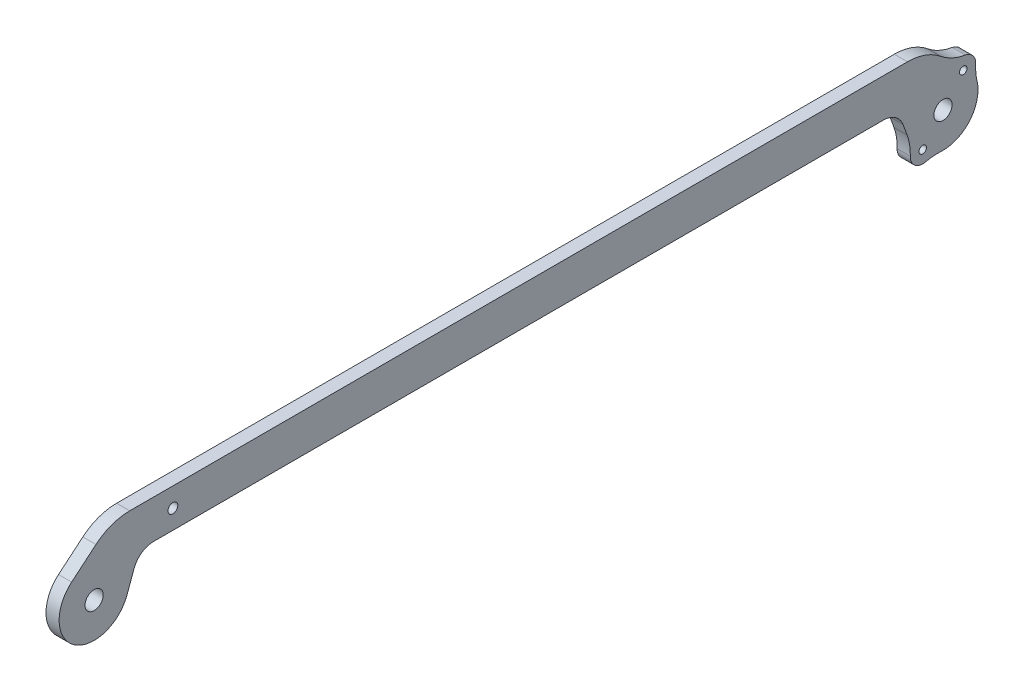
ISO-10303-21;
HEADER;
FILE_DESCRIPTION(('STEP AP214'),'2;1');
FILE_NAME('part.step','',(''),(''),'','','');
FILE_SCHEMA(('AUTOMOTIVE_DESIGN { 1 0 10303 214 1 1 1 1 }'));
ENDSEC;
DATA;
#1=APPLICATION_CONTEXT('core data for automotive mechanical design processes');
#2=APPLICATION_PROTOCOL_DEFINITION('international standard','automotive_design',2000,#1);
#3=PRODUCT_CONTEXT('',#1,'mechanical');
#4=PRODUCT('Part','Part','',(#3));
#5=PRODUCT_RELATED_PRODUCT_CATEGORY('part','',(#4));
#6=PRODUCT_DEFINITION_FORMATION('','',#4);
#7=PRODUCT_DEFINITION_CONTEXT('part definition',#1,'design');
#8=PRODUCT_DEFINITION('design','',#6,#7);
#9=PRODUCT_DEFINITION_SHAPE('','',#8);
#10=(LENGTH_UNIT() NAMED_UNIT(*) SI_UNIT(.MILLI.,.METRE.));
#11=(NAMED_UNIT(*) PLANE_ANGLE_UNIT() SI_UNIT($,.RADIAN.));
#12=(NAMED_UNIT(*) SI_UNIT($,.STERADIAN.) SOLID_ANGLE_UNIT());
#13=UNCERTAINTY_MEASURE_WITH_UNIT(LENGTH_MEASURE(1.E-05),#10,'distance_accuracy_value','');
#14=(GEOMETRIC_REPRESENTATION_CONTEXT(3) GLOBAL_UNCERTAINTY_ASSIGNED_CONTEXT((#13)) GLOBAL_UNIT_ASSIGNED_CONTEXT((#10,
#11,#12)) REPRESENTATION_CONTEXT('',''));
#15=CARTESIAN_POINT('',(0.,0.,0.));
#16=DIRECTION('',(0.,0.,1.));
#17=DIRECTION('',(1.,0.,0.));
#18=AXIS2_PLACEMENT_3D('',#15,#16,#17);
#19=CARTESIAN_POINT('',(4.7625,0.,-307.975));
#20=DIRECTION('',(-1.,0.,0.));
#21=DIRECTION('',(0.,0.,1.));
#22=AXIS2_PLACEMENT_3D('',#19,#20,#21);
#23=CYLINDRICAL_SURFACE('',#22,12.7);
#24=DIRECTION('',(1.,0.,0.));
#25=VECTOR('',#24,1.);
#26=CARTESIAN_POINT('',(-19.6871358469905,-12.6774406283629,-307.218363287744));
#27=LINE('',#26,#25);
#28=CARTESIAN_POINT('',(0.,-12.6774406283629,-307.218363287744));
#29=VERTEX_POINT('',#28);
#30=CARTESIAN_POINT('',(4.7625,-12.6774406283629,-307.218363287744));
#31=VERTEX_POINT('',#30);
#32=EDGE_CURVE('E195',#29,#31,#27,.T.);
#33=ORIENTED_EDGE('',*,*,#32,.F.);
#34=CARTESIAN_POINT('',(0.,0.,-307.975));
#35=DIRECTION('',(1.,0.,0.));
#36=DIRECTION('',(0.,0.,-1.));
#37=AXIS2_PLACEMENT_3D('',#34,#35,#36);
#38=CIRCLE('',#37,12.7);
#39=CARTESIAN_POINT('',(0.,2.94655616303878,-320.328453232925));
#40=VERTEX_POINT('',#39);
#41=EDGE_CURVE('E289',#29,#40,#38,.T.);
#42=ORIENTED_EDGE('',*,*,#41,.T.);
#43=DIRECTION('',(1.,0.,0.));
#44=VECTOR('',#43,1.);
#45=CARTESIAN_POINT('',(-19.6871358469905,2.94655616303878,-320.328453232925));
#46=LINE('',#45,#44);
#47=CARTESIAN_POINT('',(4.7625,2.94655616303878,-320.328453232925));
#48=VERTEX_POINT('',#47);
#49=EDGE_CURVE('E227',#40,#48,#46,.T.);
#50=ORIENTED_EDGE('',*,*,#49,.T.);
#51=CARTESIAN_POINT('',(4.7625,0.,-307.975));
#52=DIRECTION('',(1.,0.,0.));
#53=DIRECTION('',(0.,0.,-1.));
#54=AXIS2_PLACEMENT_3D('',#51,#52,#53);
#55=CIRCLE('',#54,12.7);
#56=EDGE_CURVE('E270',#31,#48,#55,.T.);
#57=ORIENTED_EDGE('',*,*,#56,.F.);
#58=EDGE_LOOP('',(#33,#42,#50,#57));
#59=FACE_BOUND('',#58,.T.);
#60=ADVANCED_FACE('F60',(#59),#23,.T.);
#61=CARTESIAN_POINT('',(4.7625,0.,-21.6240923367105));
#62=DIRECTION('',(-1.,0.,0.));
#63=DIRECTION('',(0.,0.,1.));
#64=AXIS2_PLACEMENT_3D('',#61,#62,#63);
#65=PLANE('',#64);
#66=CARTESIAN_POINT('',(4.7625,14.605,-28.575));
#67=DIRECTION('',(1.,0.,0.));
#68=DIRECTION('',(0.,0.,-1.));
#69=AXIS2_PLACEMENT_3D('',#66,#67,#68);
#70=CIRCLE('',#69,1.778);
#71=CARTESIAN_POINT('',(4.7625,14.605,-30.353));
#72=VERTEX_POINT('',#71);
#73=EDGE_CURVE('E469',#72,#72,#70,.T.);
#74=ORIENTED_EDGE('',*,*,#73,.F.);
#75=EDGE_LOOP('',(#74));
#76=FACE_BOUND('',#75,.T.);
#77=CARTESIAN_POINT('',(4.7625,8.75588798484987,-315.322062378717));
#78=DIRECTION('',(1.,0.,0.));
#79=DIRECTION('',(0.,0.,-1.));
#80=AXIS2_PLACEMENT_3D('',#77,#78,#79);
#81=CIRCLE('',#80,1.35255000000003);
#82=CARTESIAN_POINT('',(4.7625,8.75588798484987,-316.674612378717));
#83=VERTEX_POINT('',#82);
#84=EDGE_CURVE('E215',#83,#83,#81,.T.);
#85=ORIENTED_EDGE('',*,*,#84,.F.);
#86=EDGE_LOOP('',(#85));
#87=FACE_BOUND('',#86,.T.);
#88=CARTESIAN_POINT('',(4.7625,-8.75588798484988,-300.627937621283));
#89=DIRECTION('',(1.,0.,0.));
#90=DIRECTION('',(0.,0.,-1.));
#91=AXIS2_PLACEMENT_3D('',#88,#89,#90);
#92=CIRCLE('',#91,1.35255000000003);
#93=CARTESIAN_POINT('',(4.7625,-8.75588798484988,-301.980487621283));
#94=VERTEX_POINT('',#93);
#95=EDGE_CURVE('E363',#94,#94,#92,.T.);
#96=ORIENTED_EDGE('',*,*,#95,.F.);
#97=EDGE_LOOP('',(#96));
#98=FACE_BOUND('',#97,.T.);
#99=DIRECTION('',(0.,0.,1.));
#100=VECTOR('',#99,1.);
#101=CARTESIAN_POINT('',(4.7625,21.59,-5.97226746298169));
#102=LINE('',#101,#100);
#103=CARTESIAN_POINT('',(4.7625,21.59,-295.07308975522));
#104=VERTEX_POINT('',#103);
#105=CARTESIAN_POINT('',(4.7625,21.59,-12.9059004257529));
#106=VERTEX_POINT('',#105);
#107=EDGE_CURVE('E272',#104,#106,#102,.T.);
#108=ORIENTED_EDGE('',*,*,#107,.T.);
#109=CARTESIAN_POINT('',(4.7625,2.54,-12.9059004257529));
#110=DIRECTION('',(-1.,0.,0.));
#111=DIRECTION('',(0.,0.,1.));
#112=AXIS2_PLACEMENT_3D('',#109,#110,#111);
#113=CIRCLE('',#112,19.05);
#114=CARTESIAN_POINT('',(4.7625,17.1331466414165,-0.660796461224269));
#115=VERTEX_POINT('',#114);
#116=EDGE_CURVE('E68',#106,#115,#113,.F.);
#117=ORIENTED_EDGE('',*,*,#116,.T.);
#118=DIRECTION('',(0.,-0.642787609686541,0.766044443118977));
#119=VECTOR('',#118,1.);
#120=CARTESIAN_POINT('',(4.7625,9.72876442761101,8.16340264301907));
#121=LINE('',#120,#119);
#122=CARTESIAN_POINT('',(4.7625,9.728764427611,8.16340264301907));
#123=VERTEX_POINT('',#122);
#124=EDGE_CURVE('E274',#115,#123,#121,.T.);
#125=ORIENTED_EDGE('',*,*,#124,.T.);
#126=CARTESIAN_POINT('',(4.7625,0.,0.));
#127=DIRECTION('',(1.,0.,0.));
#128=DIRECTION('',(0.,0.,-1.));
#129=AXIS2_PLACEMENT_3D('',#126,#127,#128);
#130=CIRCLE('',#129,12.7);
#131=CARTESIAN_POINT('',(4.7625,-4.343655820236,-11.934096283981));
#132=VERTEX_POINT('',#131);
#133=EDGE_CURVE('E276',#123,#132,#130,.T.);
#134=ORIENTED_EDGE('',*,*,#133,.T.);
#135=DIRECTION('',(0.,0.939692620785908,-0.342020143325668));
#136=VECTOR('',#135,1.);
#137=CARTESIAN_POINT('',(4.7625,-4.343655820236,-11.934096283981));
#138=LINE('',#137,#136);
#139=CARTESIAN_POINT('',(4.7625,2.6061934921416,-14.4636345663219));
#140=VERTEX_POINT('',#139);
#141=EDGE_CURVE('E278',#132,#140,#138,.T.);
#142=ORIENTED_EDGE('',*,*,#141,.T.);
#143=CARTESIAN_POINT('',(4.7625,0.,-21.6240923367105));
#144=DIRECTION('',(-1.,0.,0.));
#145=DIRECTION('',(0.,0.,1.));
#146=AXIS2_PLACEMENT_3D('',#143,#144,#145);
#147=CIRCLE('',#146,7.62);
#148=CARTESIAN_POINT('',(4.7625,7.62,-21.6240923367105));
#149=VERTEX_POINT('',#148);
#150=EDGE_CURVE('E259',#140,#149,#147,.T.);
#151=ORIENTED_EDGE('',*,*,#150,.T.);
#152=DIRECTION('',(0.,0.,-1.));
#153=VECTOR('',#152,1.);
#154=CARTESIAN_POINT('',(4.7625,7.62,-21.6240923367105));
#155=LINE('',#154,#153);
#156=CARTESIAN_POINT('',(4.7625,7.62000000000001,-286.350907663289));
#157=VERTEX_POINT('',#156);
#158=EDGE_CURVE('E262',#149,#157,#155,.T.);
#159=ORIENTED_EDGE('',*,*,#158,.T.);
#160=CARTESIAN_POINT('',(4.7625,0.,-286.350907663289));
#161=DIRECTION('',(-1.,0.,0.));
#162=DIRECTION('',(0.,0.,1.));
#163=AXIS2_PLACEMENT_3D('',#160,#161,#162);
#164=CIRCLE('',#163,7.62000000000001);
#165=CARTESIAN_POINT('',(4.7625,2.60619349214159,-293.511365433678));
#166=VERTEX_POINT('',#165);
#167=EDGE_CURVE('E265',#157,#166,#164,.T.);
#168=ORIENTED_EDGE('',*,*,#167,.T.);
#169=DIRECTION('',(0.,-0.939692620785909,-0.342020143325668));
#170=VECTOR('',#169,1.);
#171=CARTESIAN_POINT('',(4.7625,2.60619349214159,-293.511365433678));
#172=LINE('',#171,#170);
#173=CARTESIAN_POINT('',(4.7625,-1.39253114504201,-294.96678217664));
#174=VERTEX_POINT('',#173);
#175=EDGE_CURVE('E267',#166,#174,#172,.T.);
#176=ORIENTED_EDGE('',*,*,#175,.T.);
#177=CARTESIAN_POINT('',(4.7625,-7.90801487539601,-277.065637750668));
#178=DIRECTION('',(1.,0.,0.));
#179=DIRECTION('',(0.,0.,-1.));
#180=AXIS2_PLACEMENT_3D('',#177,#178,#179);
#181=CIRCLE('',#180,19.05);
#182=CARTESIAN_POINT('',(4.7625,-8.59307259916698,-296.103316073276));
#183=VERTEX_POINT('',#182);
#184=EDGE_CURVE('E206',#183,#174,#181,.T.);
#185=ORIENTED_EDGE('',*,*,#184,.F.);
#186=CARTESIAN_POINT('',(4.7625,-8.75588798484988,-300.627937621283));
#187=DIRECTION('',(1.,0.,0.));
#188=DIRECTION('',(0.,0.,-1.));
#189=AXIS2_PLACEMENT_3D('',#186,#187,#188);
#190=CIRCLE('',#189,4.52755000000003);
#191=CARTESIAN_POINT('',(4.7625,-13.1605714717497,-301.675540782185));
#192=VERTEX_POINT('',#191);
#193=EDGE_CURVE('E202',#183,#192,#190,.T.);
#194=ORIENTED_EDGE('',*,*,#193,.T.);
#195=CARTESIAN_POINT('',(4.7625,-31.6936015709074,-306.083408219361));
#196=DIRECTION('',(1.,0.,0.));
#197=DIRECTION('',(0.,0.,-1.));
#198=AXIS2_PLACEMENT_3D('',#195,#196,#197);
#199=CIRCLE('',#198,19.05);
#200=EDGE_CURVE('E212',#192,#31,#199,.F.);
#201=ORIENTED_EDGE('',*,*,#200,.T.);
#202=ORIENTED_EDGE('',*,*,#56,.T.);
#203=CARTESIAN_POINT('',(4.7625,7.36639040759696,-338.858633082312));
#204=DIRECTION('',(1.,0.,0.));
#205=DIRECTION('',(0.,0.,-1.));
#206=AXIS2_PLACEMENT_3D('',#203,#204,#205);
#207=CIRCLE('',#206,19.05);
#208=CARTESIAN_POINT('',(4.7625,8.48906553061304,-319.84174320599));
#209=VERTEX_POINT('',#208);
#210=EDGE_CURVE('E229',#209,#48,#207,.T.);
#211=ORIENTED_EDGE('',*,*,#210,.F.);
#212=CARTESIAN_POINT('',(4.7625,8.75588798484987,-315.322062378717));
#213=DIRECTION('',(1.,0.,0.));
#214=DIRECTION('',(0.,0.,-1.));
#215=AXIS2_PLACEMENT_3D('',#212,#213,#214);
#216=CIRCLE('',#215,4.52755000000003);
#217=CARTESIAN_POINT('',(4.7625,13.2210391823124,-316.071151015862));
#218=VERTEX_POINT('',#217);
#219=EDGE_CURVE('E224',#209,#218,#216,.T.);
#220=ORIENTED_EDGE('',*,*,#219,.T.);
#221=CARTESIAN_POINT('',(4.7625,32.0084916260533,-319.222996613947));
#222=DIRECTION('',(1.,0.,0.));
#223=DIRECTION('',(0.,0.,-1.));
#224=AXIS2_PLACEMENT_3D('',#221,#222,#223);
#225=CIRCLE('',#224,19.05);
#226=CARTESIAN_POINT('',(4.7625,17.2742458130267,-307.148043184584));
#227=VERTEX_POINT('',#226);
#228=EDGE_CURVE('E228',#218,#227,#225,.F.);
#229=ORIENTED_EDGE('',*,*,#228,.T.);
#230=CARTESIAN_POINT('',(4.7625,2.54000000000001,-295.07308975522));
#231=DIRECTION('',(-1.,0.,0.));
#232=DIRECTION('',(0.,0.,1.));
#233=AXIS2_PLACEMENT_3D('',#230,#231,#232);
#234=CIRCLE('',#233,19.05);
#235=EDGE_CURVE('E326',#227,#104,#234,.F.);
#236=ORIENTED_EDGE('',*,*,#235,.T.);
#237=EDGE_LOOP('',(#108,#117,#125,#134,#142,#151,#159,#168,#176,#185,#194,#201,#202,#211,#220,
#229,#236));
#238=FACE_BOUND('',#237,.T.);
#239=CARTESIAN_POINT('',(4.7625,0.,0.));
#240=DIRECTION('',(1.,0.,0.));
#241=DIRECTION('',(0.,0.,-1.));
#242=AXIS2_PLACEMENT_3D('',#239,#240,#241);
#243=CIRCLE('',#242,3.302);
#244=CARTESIAN_POINT('',(4.7625,0.,3.302));
#245=VERTEX_POINT('',#244);
#246=EDGE_CURVE('E253',#245,#245,#243,.T.);
#247=ORIENTED_EDGE('',*,*,#246,.F.);
#248=EDGE_LOOP('',(#247));
#249=FACE_BOUND('',#248,.T.);
#250=CARTESIAN_POINT('',(4.7625,0.,-307.975));
#251=DIRECTION('',(1.,0.,0.));
#252=DIRECTION('',(0.,0.,-1.));
#253=AXIS2_PLACEMENT_3D('',#250,#251,#252);
#254=CIRCLE('',#253,3.30200000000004);
#255=CARTESIAN_POINT('',(4.7625,0.,-304.673));
#256=VERTEX_POINT('',#255);
#257=EDGE_CURVE('E247',#256,#256,#254,.T.);
#258=ORIENTED_EDGE('',*,*,#257,.F.);
#259=EDGE_LOOP('',(#258));
#260=FACE_BOUND('',#259,.T.);
#261=ADVANCED_FACE('F330',(#76,#87,#98,#238,#249,#260),#65,.F.);
#262=CARTESIAN_POINT('',(0.,0.,-21.6240923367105));
#263=DIRECTION('',(-1.,0.,0.));
#264=DIRECTION('',(0.,0.,1.));
#265=AXIS2_PLACEMENT_3D('',#262,#263,#264);
#266=PLANE('',#265);
#267=CARTESIAN_POINT('',(0.,14.605,-28.575));
#268=DIRECTION('',(1.,0.,0.));
#269=DIRECTION('',(0.,0.,-1.));
#270=AXIS2_PLACEMENT_3D('',#267,#268,#269);
#271=CIRCLE('',#270,1.778);
#272=CARTESIAN_POINT('',(0.,14.605,-30.353));
#273=VERTEX_POINT('',#272);
#274=EDGE_CURVE('E460',#273,#273,#271,.T.);
#275=ORIENTED_EDGE('',*,*,#274,.T.);
#276=EDGE_LOOP('',(#275));
#277=FACE_BOUND('',#276,.T.);
#278=CARTESIAN_POINT('',(0.,8.75588798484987,-315.322062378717));
#279=DIRECTION('',(1.,0.,0.));
#280=DIRECTION('',(0.,0.,-1.));
#281=AXIS2_PLACEMENT_3D('',#278,#279,#280);
#282=CIRCLE('',#281,1.35255000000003);
#283=CARTESIAN_POINT('',(0.,8.75588798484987,-316.674612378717));
#284=VERTEX_POINT('',#283);
#285=EDGE_CURVE('E210',#284,#284,#282,.T.);
#286=ORIENTED_EDGE('',*,*,#285,.T.);
#287=EDGE_LOOP('',(#286));
#288=FACE_BOUND('',#287,.T.);
#289=CARTESIAN_POINT('',(0.,-8.75588798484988,-300.627937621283));
#290=DIRECTION('',(1.,0.,0.));
#291=DIRECTION('',(0.,0.,-1.));
#292=AXIS2_PLACEMENT_3D('',#289,#290,#291);
#293=CIRCLE('',#292,1.35255000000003);
#294=CARTESIAN_POINT('',(0.,-8.75588798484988,-301.980487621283));
#295=VERTEX_POINT('',#294);
#296=EDGE_CURVE('E464',#295,#295,#293,.T.);
#297=ORIENTED_EDGE('',*,*,#296,.T.);
#298=EDGE_LOOP('',(#297));
#299=FACE_BOUND('',#298,.T.);
#300=DIRECTION('',(0.,-0.642787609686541,0.766044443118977));
#301=VECTOR('',#300,1.);
#302=CARTESIAN_POINT('',(0.,9.72876442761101,8.16340264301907));
#303=LINE('',#302,#301);
#304=CARTESIAN_POINT('',(0.,17.1331466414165,-0.660796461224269));
#305=VERTEX_POINT('',#304);
#306=CARTESIAN_POINT('',(0.,9.728764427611,8.16340264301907));
#307=VERTEX_POINT('',#306);
#308=EDGE_CURVE('E293',#305,#307,#303,.T.);
#309=ORIENTED_EDGE('',*,*,#308,.F.);
#310=CARTESIAN_POINT('',(0.,2.54,-12.9059004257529));
#311=DIRECTION('',(-1.,0.,0.));
#312=DIRECTION('',(0.,0.,1.));
#313=AXIS2_PLACEMENT_3D('',#310,#311,#312);
#314=CIRCLE('',#313,19.05);
#315=CARTESIAN_POINT('',(0.,21.59,-12.9059004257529));
#316=VERTEX_POINT('',#315);
#317=EDGE_CURVE('E320',#305,#316,#314,.T.);
#318=ORIENTED_EDGE('',*,*,#317,.T.);
#319=DIRECTION('',(0.,0.,1.));
#320=VECTOR('',#319,1.);
#321=CARTESIAN_POINT('',(0.,21.59,-5.97226746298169));
#322=LINE('',#321,#320);
#323=CARTESIAN_POINT('',(0.,21.59,-295.07308975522));
#324=VERTEX_POINT('',#323);
#325=EDGE_CURVE('E291',#324,#316,#322,.T.);
#326=ORIENTED_EDGE('',*,*,#325,.F.);
#327=CARTESIAN_POINT('',(0.,2.54000000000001,-295.07308975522));
#328=DIRECTION('',(-1.,0.,0.));
#329=DIRECTION('',(0.,0.,1.));
#330=AXIS2_PLACEMENT_3D('',#327,#328,#329);
#331=CIRCLE('',#330,19.05);
#332=CARTESIAN_POINT('',(0.,17.2742458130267,-307.148043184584));
#333=VERTEX_POINT('',#332);
#334=EDGE_CURVE('E318',#324,#333,#331,.T.);
#335=ORIENTED_EDGE('',*,*,#334,.T.);
#336=CARTESIAN_POINT('',(0.,32.0084916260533,-319.222996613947));
#337=DIRECTION('',(-1.,0.,0.));
#338=DIRECTION('',(0.,0.,1.));
#339=AXIS2_PLACEMENT_3D('',#336,#337,#338);
#340=CIRCLE('',#339,19.05);
#341=CARTESIAN_POINT('',(0.,13.2210391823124,-316.071151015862));
#342=VERTEX_POINT('',#341);
#343=EDGE_CURVE('E235',#342,#333,#340,.T.);
#344=ORIENTED_EDGE('',*,*,#343,.F.);
#345=CARTESIAN_POINT('',(0.,8.75588798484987,-315.322062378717));
#346=DIRECTION('',(-1.,0.,0.));
#347=DIRECTION('',(0.,0.,1.));
#348=AXIS2_PLACEMENT_3D('',#345,#346,#347);
#349=CIRCLE('',#348,4.52755000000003);
#350=CARTESIAN_POINT('',(0.,8.48906553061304,-319.84174320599));
#351=VERTEX_POINT('',#350);
#352=EDGE_CURVE('E232',#351,#342,#349,.F.);
#353=ORIENTED_EDGE('',*,*,#352,.F.);
#354=CARTESIAN_POINT('',(0.,7.36639040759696,-338.858633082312));
#355=DIRECTION('',(-1.,0.,0.));
#356=DIRECTION('',(0.,0.,1.));
#357=AXIS2_PLACEMENT_3D('',#354,#355,#356);
#358=CIRCLE('',#357,19.05);
#359=EDGE_CURVE('E220',#351,#40,#358,.F.);
#360=ORIENTED_EDGE('',*,*,#359,.T.);
#361=ORIENTED_EDGE('',*,*,#41,.F.);
#362=CARTESIAN_POINT('',(0.,-31.6936015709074,-306.083408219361));
#363=DIRECTION('',(-1.,0.,0.));
#364=DIRECTION('',(0.,0.,1.));
#365=AXIS2_PLACEMENT_3D('',#362,#363,#364);
#366=CIRCLE('',#365,19.05);
#367=CARTESIAN_POINT('',(0.,-13.1605714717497,-301.675540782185));
#368=VERTEX_POINT('',#367);
#369=EDGE_CURVE('E192',#368,#29,#366,.T.);
#370=ORIENTED_EDGE('',*,*,#369,.F.);
#371=CARTESIAN_POINT('',(0.,-8.75588798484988,-300.627937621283));
#372=DIRECTION('',(-1.,0.,0.));
#373=DIRECTION('',(0.,0.,1.));
#374=AXIS2_PLACEMENT_3D('',#371,#372,#373);
#375=CIRCLE('',#374,4.52755000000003);
#376=CARTESIAN_POINT('',(0.,-8.59307259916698,-296.103316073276));
#377=VERTEX_POINT('',#376);
#378=EDGE_CURVE('E181',#377,#368,#375,.F.);
#379=ORIENTED_EDGE('',*,*,#378,.F.);
#380=CARTESIAN_POINT('',(0.,-7.90801487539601,-277.065637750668));
#381=DIRECTION('',(-1.,0.,0.));
#382=DIRECTION('',(0.,0.,1.));
#383=AXIS2_PLACEMENT_3D('',#380,#381,#382);
#384=CIRCLE('',#383,19.05);
#385=CARTESIAN_POINT('',(0.,-1.39253114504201,-294.96678217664));
#386=VERTEX_POINT('',#385);
#387=EDGE_CURVE('E188',#377,#386,#384,.F.);
#388=ORIENTED_EDGE('',*,*,#387,.T.);
#389=DIRECTION('',(0.,-0.939692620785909,-0.342020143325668));
#390=VECTOR('',#389,1.);
#391=CARTESIAN_POINT('',(0.,2.60619349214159,-293.511365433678));
#392=LINE('',#391,#390);
#393=CARTESIAN_POINT('',(0.,2.60619349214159,-293.511365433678));
#394=VERTEX_POINT('',#393);
#395=EDGE_CURVE('E287',#394,#386,#392,.T.);
#396=ORIENTED_EDGE('',*,*,#395,.F.);
#397=CARTESIAN_POINT('',(0.,0.,-286.350907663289));
#398=DIRECTION('',(-1.,0.,0.));
#399=DIRECTION('',(0.,0.,1.));
#400=AXIS2_PLACEMENT_3D('',#397,#398,#399);
#401=CIRCLE('',#400,7.62000000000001);
#402=CARTESIAN_POINT('',(0.,7.62000000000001,-286.350907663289));
#403=VERTEX_POINT('',#402);
#404=EDGE_CURVE('E285',#403,#394,#401,.T.);
#405=ORIENTED_EDGE('',*,*,#404,.F.);
#406=DIRECTION('',(0.,0.,-1.));
#407=VECTOR('',#406,1.);
#408=CARTESIAN_POINT('',(0.,7.62,-21.6240923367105));
#409=LINE('',#408,#407);
#410=CARTESIAN_POINT('',(0.,7.62,-21.6240923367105));
#411=VERTEX_POINT('',#410);
#412=EDGE_CURVE('E283',#411,#403,#409,.T.);
#413=ORIENTED_EDGE('',*,*,#412,.F.);
#414=CARTESIAN_POINT('',(0.,0.,-21.6240923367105));
#415=DIRECTION('',(-1.,0.,0.));
#416=DIRECTION('',(0.,0.,1.));
#417=AXIS2_PLACEMENT_3D('',#414,#415,#416);
#418=CIRCLE('',#417,7.62);
#419=CARTESIAN_POINT('',(0.,2.6061934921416,-14.4636345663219));
#420=VERTEX_POINT('',#419);
#421=EDGE_CURVE('E256',#420,#411,#418,.T.);
#422=ORIENTED_EDGE('',*,*,#421,.F.);
#423=DIRECTION('',(0.,0.939692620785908,-0.342020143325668));
#424=VECTOR('',#423,1.);
#425=CARTESIAN_POINT('',(0.,-4.343655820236,-11.934096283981));
#426=LINE('',#425,#424);
#427=CARTESIAN_POINT('',(0.,-4.343655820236,-11.934096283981));
#428=VERTEX_POINT('',#427);
#429=EDGE_CURVE('E263',#428,#420,#426,.T.);
#430=ORIENTED_EDGE('',*,*,#429,.F.);
#431=CARTESIAN_POINT('',(0.,0.,0.));
#432=DIRECTION('',(1.,0.,0.));
#433=DIRECTION('',(0.,0.,-1.));
#434=AXIS2_PLACEMENT_3D('',#431,#432,#433);
#435=CIRCLE('',#434,12.7);
#436=EDGE_CURVE('E295',#307,#428,#435,.T.);
#437=ORIENTED_EDGE('',*,*,#436,.F.);
#438=EDGE_LOOP('',(#309,#318,#326,#335,#344,#353,#360,#361,#370,#379,#388,#396,#405,#413,#422,
#430,#437));
#439=FACE_BOUND('',#438,.T.);
#440=CARTESIAN_POINT('',(0.,0.,0.));
#441=DIRECTION('',(1.,0.,0.));
#442=DIRECTION('',(0.,0.,-1.));
#443=AXIS2_PLACEMENT_3D('',#440,#441,#442);
#444=CIRCLE('',#443,3.302);
#445=CARTESIAN_POINT('',(0.,0.,3.302));
#446=VERTEX_POINT('',#445);
#447=EDGE_CURVE('E250',#446,#446,#444,.T.);
#448=ORIENTED_EDGE('',*,*,#447,.T.);
#449=EDGE_LOOP('',(#448));
#450=FACE_BOUND('',#449,.T.);
#451=CARTESIAN_POINT('',(0.,0.,-307.975));
#452=DIRECTION('',(1.,0.,0.));
#453=DIRECTION('',(0.,0.,-1.));
#454=AXIS2_PLACEMENT_3D('',#451,#452,#453);
#455=CIRCLE('',#454,3.30200000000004);
#456=CARTESIAN_POINT('',(0.,0.,-304.673));
#457=VERTEX_POINT('',#456);
#458=EDGE_CURVE('E237',#457,#457,#455,.T.);
#459=ORIENTED_EDGE('',*,*,#458,.T.);
#460=EDGE_LOOP('',(#459));
#461=FACE_BOUND('',#460,.T.);
#462=ADVANCED_FACE('F184',(#277,#288,#299,#439,#450,#461),#266,.T.);
#463=CARTESIAN_POINT('',(4.7625,0.,-21.6240923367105));
#464=DIRECTION('',(-1.,0.,0.));
#465=DIRECTION('',(0.,0.,1.));
#466=AXIS2_PLACEMENT_3D('',#463,#464,#465);
#467=CYLINDRICAL_SURFACE('',#466,7.62);
#468=ORIENTED_EDGE('',*,*,#421,.T.);
#469=DIRECTION('',(-1.,0.,0.));
#470=VECTOR('',#469,1.);
#471=CARTESIAN_POINT('',(4.7625,7.62,-21.6240923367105));
#472=LINE('',#471,#470);
#473=EDGE_CURVE('E312',#149,#411,#472,.T.);
#474=ORIENTED_EDGE('',*,*,#473,.F.);
#475=ORIENTED_EDGE('',*,*,#150,.F.);
#476=DIRECTION('',(-1.,0.,0.));
#477=VECTOR('',#476,1.);
#478=CARTESIAN_POINT('',(4.7625,2.6061934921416,-14.4636345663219));
#479=LINE('',#478,#477);
#480=EDGE_CURVE('E280',#140,#420,#479,.T.);
#481=ORIENTED_EDGE('',*,*,#480,.T.);
#482=EDGE_LOOP('',(#468,#474,#475,#481));
#483=FACE_BOUND('',#482,.T.);
#484=ADVANCED_FACE('F381',(#483),#467,.F.);
#485=CARTESIAN_POINT('',(4.7625,7.62,-21.6240923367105));
#486=DIRECTION('',(0.,1.,0.));
#487=DIRECTION('',(0.,0.,1.));
#488=AXIS2_PLACEMENT_3D('',#485,#486,#487);
#489=PLANE('',#488);
#490=ORIENTED_EDGE('',*,*,#412,.T.);
#491=DIRECTION('',(-1.,0.,0.));
#492=VECTOR('',#491,1.);
#493=CARTESIAN_POINT('',(4.7625,7.62000000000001,-286.350907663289));
#494=LINE('',#493,#492);
#495=EDGE_CURVE('E309',#157,#403,#494,.T.);
#496=ORIENTED_EDGE('',*,*,#495,.F.);
#497=ORIENTED_EDGE('',*,*,#158,.F.);
#498=ORIENTED_EDGE('',*,*,#473,.T.);
#499=EDGE_LOOP('',(#490,#496,#497,#498));
#500=FACE_BOUND('',#499,.T.);
#501=ADVANCED_FACE('F378',(#500),#489,.F.);
#502=CARTESIAN_POINT('',(4.7625,0.,-286.350907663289));
#503=DIRECTION('',(-1.,0.,0.));
#504=DIRECTION('',(0.,0.,1.));
#505=AXIS2_PLACEMENT_3D('',#502,#503,#504);
#506=CYLINDRICAL_SURFACE('',#505,7.62000000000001);
#507=ORIENTED_EDGE('',*,*,#404,.T.);
#508=DIRECTION('',(-1.,0.,0.));
#509=VECTOR('',#508,1.);
#510=CARTESIAN_POINT('',(4.7625,2.60619349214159,-293.511365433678));
#511=LINE('',#510,#509);
#512=EDGE_CURVE('E306',#166,#394,#511,.T.);
#513=ORIENTED_EDGE('',*,*,#512,.F.);
#514=ORIENTED_EDGE('',*,*,#167,.F.);
#515=ORIENTED_EDGE('',*,*,#495,.T.);
#516=EDGE_LOOP('',(#507,#513,#514,#515));
#517=FACE_BOUND('',#516,.T.);
#518=ADVANCED_FACE('F372',(#517),#506,.F.);
#519=CARTESIAN_POINT('',(4.7625,2.60619349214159,-293.511365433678));
#520=DIRECTION('',(0.,0.342020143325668,-0.939692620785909));
#521=DIRECTION('',(0.,0.939692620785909,0.342020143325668));
#522=AXIS2_PLACEMENT_3D('',#519,#520,#521);
#523=PLANE('',#522);
#524=ORIENTED_EDGE('',*,*,#395,.T.);
#525=DIRECTION('',(1.,0.,0.));
#526=VECTOR('',#525,1.);
#527=CARTESIAN_POINT('',(-19.6871358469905,-1.39253114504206,-294.96678217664));
#528=LINE('',#527,#526);
#529=EDGE_CURVE('E209',#386,#174,#528,.T.);
#530=ORIENTED_EDGE('',*,*,#529,.T.);
#531=ORIENTED_EDGE('',*,*,#175,.F.);
#532=ORIENTED_EDGE('',*,*,#512,.T.);
#533=EDGE_LOOP('',(#524,#530,#531,#532));
#534=FACE_BOUND('',#533,.T.);
#535=ADVANCED_FACE('F367',(#534),#523,.F.);
#536=CARTESIAN_POINT('',(4.7625,21.59,-5.97226746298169));
#537=DIRECTION('',(0.,-1.,0.));
#538=DIRECTION('',(0.,0.,-1.));
#539=AXIS2_PLACEMENT_3D('',#536,#537,#538);
#540=PLANE('',#539);
#541=ORIENTED_EDGE('',*,*,#325,.T.);
#542=DIRECTION('',(-1.,0.,0.));
#543=VECTOR('',#542,1.);
#544=CARTESIAN_POINT('',(4.7625,21.59,-12.9059004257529));
#545=LINE('',#544,#543);
#546=EDGE_CURVE('E81',#316,#106,#545,.F.);
#547=ORIENTED_EDGE('',*,*,#546,.T.);
#548=ORIENTED_EDGE('',*,*,#107,.F.);
#549=DIRECTION('',(-1.,0.,0.));
#550=VECTOR('',#549,1.);
#551=CARTESIAN_POINT('',(0.,21.59,-295.07308975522));
#552=LINE('',#551,#550);
#553=EDGE_CURVE('E322',#104,#324,#552,.T.);
#554=ORIENTED_EDGE('',*,*,#553,.T.);
#555=EDGE_LOOP('',(#541,#547,#548,#554));
#556=FACE_BOUND('',#555,.T.);
#557=ADVANCED_FACE('F341',(#556),#540,.F.);
#558=CARTESIAN_POINT('',(4.7625,9.72876442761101,8.16340264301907));
#559=DIRECTION('',(0.,-0.766044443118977,-0.642787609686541));
#560=DIRECTION('',(0.,0.642787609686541,-0.766044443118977));
#561=AXIS2_PLACEMENT_3D('',#558,#559,#560);
#562=PLANE('',#561);
#563=ORIENTED_EDGE('',*,*,#124,.F.);
#564=DIRECTION('',(-1.,0.,0.));
#565=VECTOR('',#564,1.);
#566=CARTESIAN_POINT('',(4.7625,17.1331466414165,-0.660796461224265));
#567=LINE('',#566,#565);
#568=EDGE_CURVE('E315',#115,#305,#567,.T.);
#569=ORIENTED_EDGE('',*,*,#568,.T.);
#570=ORIENTED_EDGE('',*,*,#308,.T.);
#571=DIRECTION('',(-1.,0.,0.));
#572=VECTOR('',#571,1.);
#573=CARTESIAN_POINT('',(4.7625,9.728764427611,8.16340264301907));
#574=LINE('',#573,#572);
#575=EDGE_CURVE('E303',#123,#307,#574,.T.);
#576=ORIENTED_EDGE('',*,*,#575,.F.);
#577=EDGE_LOOP('',(#563,#569,#570,#576));
#578=FACE_BOUND('',#577,.T.);
#579=ADVANCED_FACE('F336',(#578),#562,.F.);
#580=CARTESIAN_POINT('',(4.7625,0.,0.));
#581=DIRECTION('',(-1.,0.,0.));
#582=DIRECTION('',(0.,0.,1.));
#583=AXIS2_PLACEMENT_3D('',#580,#581,#582);
#584=CYLINDRICAL_SURFACE('',#583,12.7);
#585=ORIENTED_EDGE('',*,*,#436,.T.);
#586=DIRECTION('',(-1.,0.,0.));
#587=VECTOR('',#586,1.);
#588=CARTESIAN_POINT('',(4.7625,-4.343655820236,-11.934096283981));
#589=LINE('',#588,#587);
#590=EDGE_CURVE('E300',#132,#428,#589,.T.);
#591=ORIENTED_EDGE('',*,*,#590,.F.);
#592=ORIENTED_EDGE('',*,*,#133,.F.);
#593=ORIENTED_EDGE('',*,*,#575,.T.);
#594=EDGE_LOOP('',(#585,#591,#592,#593));
#595=FACE_BOUND('',#594,.T.);
#596=ADVANCED_FACE('F388',(#595),#584,.T.);
#597=CARTESIAN_POINT('',(4.7625,-4.343655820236,-11.934096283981));
#598=DIRECTION('',(0.,0.342020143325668,0.939692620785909));
#599=DIRECTION('',(0.,-0.939692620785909,0.342020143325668));
#600=AXIS2_PLACEMENT_3D('',#597,#598,#599);
#601=PLANE('',#600);
#602=ORIENTED_EDGE('',*,*,#429,.T.);
#603=ORIENTED_EDGE('',*,*,#480,.F.);
#604=ORIENTED_EDGE('',*,*,#141,.F.);
#605=ORIENTED_EDGE('',*,*,#590,.T.);
#606=EDGE_LOOP('',(#602,#603,#604,#605));
#607=FACE_BOUND('',#606,.T.);
#608=ADVANCED_FACE('F385',(#607),#601,.F.);
#609=CARTESIAN_POINT('',(4.7625,0.,0.));
#610=DIRECTION('',(-1.,0.,0.));
#611=DIRECTION('',(0.,0.,1.));
#612=AXIS2_PLACEMENT_3D('',#609,#610,#611);
#613=CYLINDRICAL_SURFACE('',#612,3.302);
#614=CARTESIAN_POINT('',(4.7625,0.,3.302));
#615=CARTESIAN_POINT('',(4.712890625,0.,3.302));
#616=CARTESIAN_POINT('',(4.66328125,0.,3.302));
#617=CARTESIAN_POINT('',(4.5640625,0.,3.302));
#618=CARTESIAN_POINT('',(4.514453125,0.,3.302));
#619=CARTESIAN_POINT('',(4.415234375,0.,3.302));
#620=CARTESIAN_POINT('',(4.365625,0.,3.302));
#621=CARTESIAN_POINT('',(4.26640625,0.,3.302));
#622=CARTESIAN_POINT('',(4.216796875,0.,3.302));
#623=CARTESIAN_POINT('',(4.117578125,0.,3.302));
#624=CARTESIAN_POINT('',(4.06796875,0.,3.302));
#625=CARTESIAN_POINT('',(3.96875,0.,3.302));
#626=CARTESIAN_POINT('',(3.919140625,0.,3.302));
#627=CARTESIAN_POINT('',(3.819921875,0.,3.302));
#628=CARTESIAN_POINT('',(3.7703125,0.,3.302));
#629=CARTESIAN_POINT('',(3.67109375,0.,3.302));
#630=CARTESIAN_POINT('',(3.621484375,0.,3.302));
#631=CARTESIAN_POINT('',(3.522265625,0.,3.302));
#632=CARTESIAN_POINT('',(3.47265625,0.,3.302));
#633=CARTESIAN_POINT('',(3.3734375,0.,3.302));
#634=CARTESIAN_POINT('',(3.323828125,0.,3.302));
#635=CARTESIAN_POINT('',(3.224609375,0.,3.302));
#636=CARTESIAN_POINT('',(3.175,0.,3.302));
#637=CARTESIAN_POINT('',(3.07578125,0.,3.302));
#638=CARTESIAN_POINT('',(3.026171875,0.,3.302));
#639=CARTESIAN_POINT('',(2.926953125,0.,3.302));
#640=CARTESIAN_POINT('',(2.87734375,0.,3.302));
#641=CARTESIAN_POINT('',(2.778125,0.,3.302));
#642=CARTESIAN_POINT('',(2.728515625,0.,3.302));
#643=CARTESIAN_POINT('',(2.629296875,0.,3.302));
#644=CARTESIAN_POINT('',(2.5796875,0.,3.302));
#645=CARTESIAN_POINT('',(2.48046875,0.,3.302));
#646=CARTESIAN_POINT('',(2.430859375,0.,3.302));
#647=CARTESIAN_POINT('',(2.331640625,0.,3.302));
#648=CARTESIAN_POINT('',(2.28203125,0.,3.302));
#649=CARTESIAN_POINT('',(2.1828125,0.,3.302));
#650=CARTESIAN_POINT('',(2.133203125,0.,3.302));
#651=CARTESIAN_POINT('',(2.033984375,0.,3.302));
#652=CARTESIAN_POINT('',(1.984375,0.,3.302));
#653=CARTESIAN_POINT('',(1.88515625,0.,3.302));
#654=CARTESIAN_POINT('',(1.835546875,0.,3.302));
#655=CARTESIAN_POINT('',(1.736328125,0.,3.302));
#656=CARTESIAN_POINT('',(1.68671875,0.,3.302));
#657=CARTESIAN_POINT('',(1.5875,0.,3.302));
#658=CARTESIAN_POINT('',(1.537890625,0.,3.302));
#659=CARTESIAN_POINT('',(1.438671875,0.,3.302));
#660=CARTESIAN_POINT('',(1.3890625,0.,3.302));
#661=CARTESIAN_POINT('',(1.28984375,0.,3.302));
#662=CARTESIAN_POINT('',(1.240234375,0.,3.302));
#663=CARTESIAN_POINT('',(1.141015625,0.,3.302));
#664=CARTESIAN_POINT('',(1.09140625,0.,3.302));
#665=CARTESIAN_POINT('',(0.9921875,0.,3.302));
#666=CARTESIAN_POINT('',(0.942578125,0.,3.302));
#667=CARTESIAN_POINT('',(0.843359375,0.,3.302));
#668=CARTESIAN_POINT('',(0.79375,0.,3.302));
#669=CARTESIAN_POINT('',(0.69453125,0.,3.302));
#670=CARTESIAN_POINT('',(0.644921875,0.,3.302));
#671=CARTESIAN_POINT('',(0.545703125,0.,3.302));
#672=CARTESIAN_POINT('',(0.49609375,0.,3.302));
#673=CARTESIAN_POINT('',(0.396875,0.,3.302));
#674=CARTESIAN_POINT('',(0.347265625,0.,3.302));
#675=CARTESIAN_POINT('',(0.248046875,0.,3.302));
#676=CARTESIAN_POINT('',(0.1984375,0.,3.302));
#677=CARTESIAN_POINT('',(0.09921875,0.,3.302));
#678=CARTESIAN_POINT('',(0.049609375,0.,3.302));
#679=CARTESIAN_POINT('',(0.,0.,3.302));
#680=B_SPLINE_CURVE_WITH_KNOTS('',3,(#614,#615,#616,#617,#618,#619,#620,#621,#622,#623,#624,
#625,#626,#627,#628,#629,#630,#631,#632,#633,#634,#635,#636,#637,#638,#639,#640,#641,#642,#643,
#644,#645,#646,#647,#648,#649,#650,#651,#652,#653,#654,#655,#656,#657,#658,#659,#660,#661,#662,
#663,#664,#665,#666,#667,#668,#669,#670,#671,#672,#673,#674,#675,#676,#677,#678,#679),
.UNSPECIFIED.,.F.,.F.,(4,2,2,2,2,2,2,2,2,2,2,2,2,2,2,2,2,2,2,2,2,2,2,2,2,2,2,2,2,2,2,2,4),(0.,
0.148828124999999,0.297656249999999,0.446484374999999,0.595312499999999,0.744140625,0.89296875,
1.041796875,1.190625,1.339453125,1.48828125,1.637109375,1.7859375,1.934765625,2.08359375,
2.232421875,2.38125,2.530078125,2.67890625,2.827734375,2.9765625,3.125390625,3.27421875,
3.423046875,3.571875,3.720703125,3.86953125,4.018359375,4.1671875,4.316015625,4.46484375,
4.613671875,4.7625),.UNSPECIFIED.);
#681=EDGE_CURVE('BSEAM395',#245,#446,#680,.T.);
#682=ORIENTED_EDGE('',*,*,#246,.T.);
#683=ORIENTED_EDGE('',*,*,#447,.F.);
#684=ORIENTED_EDGE('',*,*,#681,.T.);
#685=ORIENTED_EDGE('',*,*,#681,.F.);
#686=EDGE_LOOP('',(#682,#684,#683,#685));
#687=FACE_BOUND('',#686,.T.);
#688=ADVANCED_FACE('F395',(#687),#613,.F.);
#689=CARTESIAN_POINT('',(4.7625,0.,-307.975));
#690=DIRECTION('',(-1.,0.,0.));
#691=DIRECTION('',(0.,0.,1.));
#692=AXIS2_PLACEMENT_3D('',#689,#690,#691);
#693=CYLINDRICAL_SURFACE('',#692,3.30200000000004);
#694=CARTESIAN_POINT('',(4.7625,0.,-304.673));
#695=CARTESIAN_POINT('',(4.712890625,0.,-304.673));
#696=CARTESIAN_POINT('',(4.66328125,0.,-304.673));
#697=CARTESIAN_POINT('',(4.5640625,0.,-304.673));
#698=CARTESIAN_POINT('',(4.514453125,0.,-304.673));
#699=CARTESIAN_POINT('',(4.415234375,0.,-304.673));
#700=CARTESIAN_POINT('',(4.365625,0.,-304.673));
#701=CARTESIAN_POINT('',(4.26640625,0.,-304.673));
#702=CARTESIAN_POINT('',(4.216796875,0.,-304.673));
#703=CARTESIAN_POINT('',(4.117578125,0.,-304.673));
#704=CARTESIAN_POINT('',(4.06796875,0.,-304.673));
#705=CARTESIAN_POINT('',(3.96875,0.,-304.673));
#706=CARTESIAN_POINT('',(3.919140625,0.,-304.673));
#707=CARTESIAN_POINT('',(3.819921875,0.,-304.673));
#708=CARTESIAN_POINT('',(3.7703125,0.,-304.673));
#709=CARTESIAN_POINT('',(3.67109375,0.,-304.673));
#710=CARTESIAN_POINT('',(3.621484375,0.,-304.673));
#711=CARTESIAN_POINT('',(3.522265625,0.,-304.673));
#712=CARTESIAN_POINT('',(3.47265625,0.,-304.673));
#713=CARTESIAN_POINT('',(3.3734375,0.,-304.673));
#714=CARTESIAN_POINT('',(3.323828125,0.,-304.673));
#715=CARTESIAN_POINT('',(3.224609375,0.,-304.673));
#716=CARTESIAN_POINT('',(3.175,0.,-304.673));
#717=CARTESIAN_POINT('',(3.07578125,0.,-304.673));
#718=CARTESIAN_POINT('',(3.026171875,0.,-304.673));
#719=CARTESIAN_POINT('',(2.926953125,0.,-304.673));
#720=CARTESIAN_POINT('',(2.87734375,0.,-304.673));
#721=CARTESIAN_POINT('',(2.778125,0.,-304.673));
#722=CARTESIAN_POINT('',(2.728515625,0.,-304.673));
#723=CARTESIAN_POINT('',(2.629296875,0.,-304.673));
#724=CARTESIAN_POINT('',(2.5796875,0.,-304.673));
#725=CARTESIAN_POINT('',(2.48046875,0.,-304.673));
#726=CARTESIAN_POINT('',(2.430859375,0.,-304.673));
#727=CARTESIAN_POINT('',(2.331640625,0.,-304.673));
#728=CARTESIAN_POINT('',(2.28203125,0.,-304.673));
#729=CARTESIAN_POINT('',(2.1828125,0.,-304.673));
#730=CARTESIAN_POINT('',(2.133203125,0.,-304.673));
#731=CARTESIAN_POINT('',(2.033984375,0.,-304.673));
#732=CARTESIAN_POINT('',(1.984375,0.,-304.673));
#733=CARTESIAN_POINT('',(1.88515625,0.,-304.673));
#734=CARTESIAN_POINT('',(1.835546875,0.,-304.673));
#735=CARTESIAN_POINT('',(1.736328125,0.,-304.673));
#736=CARTESIAN_POINT('',(1.68671875,0.,-304.673));
#737=CARTESIAN_POINT('',(1.5875,0.,-304.673));
#738=CARTESIAN_POINT('',(1.537890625,0.,-304.673));
#739=CARTESIAN_POINT('',(1.438671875,0.,-304.673));
#740=CARTESIAN_POINT('',(1.3890625,0.,-304.673));
#741=CARTESIAN_POINT('',(1.28984375,0.,-304.673));
#742=CARTESIAN_POINT('',(1.240234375,0.,-304.673));
#743=CARTESIAN_POINT('',(1.141015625,0.,-304.673));
#744=CARTESIAN_POINT('',(1.09140625,0.,-304.673));
#745=CARTESIAN_POINT('',(0.9921875,0.,-304.673));
#746=CARTESIAN_POINT('',(0.942578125,0.,-304.673));
#747=CARTESIAN_POINT('',(0.843359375,0.,-304.673));
#748=CARTESIAN_POINT('',(0.79375,0.,-304.673));
#749=CARTESIAN_POINT('',(0.69453125,0.,-304.673));
#750=CARTESIAN_POINT('',(0.644921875,0.,-304.673));
#751=CARTESIAN_POINT('',(0.545703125,0.,-304.673));
#752=CARTESIAN_POINT('',(0.49609375,0.,-304.673));
#753=CARTESIAN_POINT('',(0.396875,0.,-304.673));
#754=CARTESIAN_POINT('',(0.347265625,0.,-304.673));
#755=CARTESIAN_POINT('',(0.248046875,0.,-304.673));
#756=CARTESIAN_POINT('',(0.1984375,0.,-304.673));
#757=CARTESIAN_POINT('',(0.09921875,0.,-304.673));
#758=CARTESIAN_POINT('',(0.049609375,0.,-304.673));
#759=CARTESIAN_POINT('',(0.,0.,-304.673));
#760=B_SPLINE_CURVE_WITH_KNOTS('',3,(#694,#695,#696,#697,#698,#699,#700,#701,#702,#703,#704,
#705,#706,#707,#708,#709,#710,#711,#712,#713,#714,#715,#716,#717,#718,#719,#720,#721,#722,#723,
#724,#725,#726,#727,#728,#729,#730,#731,#732,#733,#734,#735,#736,#737,#738,#739,#740,#741,#742,
#743,#744,#745,#746,#747,#748,#749,#750,#751,#752,#753,#754,#755,#756,#757,#758,#759),
.UNSPECIFIED.,.F.,.F.,(4,2,2,2,2,2,2,2,2,2,2,2,2,2,2,2,2,2,2,2,2,2,2,2,2,2,2,2,2,2,2,2,4),(0.,
0.148828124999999,0.297656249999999,0.446484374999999,0.595312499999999,0.744140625,0.89296875,
1.041796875,1.190625,1.339453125,1.48828125,1.637109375,1.7859375,1.934765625,2.08359375,
2.232421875,2.38125,2.530078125,2.67890625,2.827734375,2.9765625,3.125390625,3.27421875,
3.423046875,3.571875,3.720703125,3.86953125,4.018359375,4.1671875,4.316015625,4.46484375,
4.613671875,4.7625),.UNSPECIFIED.);
#761=EDGE_CURVE('BSEAM446',#256,#457,#760,.T.);
#762=ORIENTED_EDGE('',*,*,#257,.T.);
#763=ORIENTED_EDGE('',*,*,#458,.F.);
#764=ORIENTED_EDGE('',*,*,#761,.T.);
#765=ORIENTED_EDGE('',*,*,#761,.F.);
#766=EDGE_LOOP('',(#762,#764,#763,#765));
#767=FACE_BOUND('',#766,.T.);
#768=ADVANCED_FACE('F446',(#767),#693,.F.);
#769=CARTESIAN_POINT('',(-19.6871358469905,7.36639040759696,-338.858633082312));
#770=DIRECTION('',(1.,0.,0.));
#771=DIRECTION('',(0.,0.,-1.));
#772=AXIS2_PLACEMENT_3D('',#769,#770,#771);
#773=CYLINDRICAL_SURFACE('',#772,19.05);
#774=ORIENTED_EDGE('',*,*,#359,.F.);
#775=DIRECTION('',(1.,0.,0.));
#776=VECTOR('',#775,1.);
#777=CARTESIAN_POINT('',(-19.6871358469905,8.48906553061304,-319.84174320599));
#778=LINE('',#777,#776);
#779=EDGE_CURVE('E233',#351,#209,#778,.T.);
#780=ORIENTED_EDGE('',*,*,#779,.T.);
#781=ORIENTED_EDGE('',*,*,#210,.T.);
#782=ORIENTED_EDGE('',*,*,#49,.F.);
#783=EDGE_LOOP('',(#774,#780,#781,#782));
#784=FACE_BOUND('',#783,.T.);
#785=ADVANCED_FACE('F354',(#784),#773,.F.);
#786=CARTESIAN_POINT('',(-19.6871358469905,8.75588798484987,-315.322062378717));
#787=DIRECTION('',(1.,0.,0.));
#788=DIRECTION('',(0.,0.,-1.));
#789=AXIS2_PLACEMENT_3D('',#786,#787,#788);
#790=CYLINDRICAL_SURFACE('',#789,4.52755000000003);
#791=ORIENTED_EDGE('',*,*,#779,.F.);
#792=ORIENTED_EDGE('',*,*,#352,.T.);
#793=DIRECTION('',(1.,0.,0.));
#794=VECTOR('',#793,1.);
#795=CARTESIAN_POINT('',(-19.6871358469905,13.2210391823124,-316.071151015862));
#796=LINE('',#795,#794);
#797=EDGE_CURVE('E238',#342,#218,#796,.T.);
#798=ORIENTED_EDGE('',*,*,#797,.T.);
#799=ORIENTED_EDGE('',*,*,#219,.F.);
#800=EDGE_LOOP('',(#791,#792,#798,#799));
#801=FACE_BOUND('',#800,.T.);
#802=ADVANCED_FACE('F350',(#801),#790,.T.);
#803=CARTESIAN_POINT('',(-19.6871358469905,32.0084916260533,-319.222996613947));
#804=DIRECTION('',(1.,0.,0.));
#805=DIRECTION('',(0.,0.,-1.));
#806=AXIS2_PLACEMENT_3D('',#803,#804,#805);
#807=CYLINDRICAL_SURFACE('',#806,19.05);
#808=ORIENTED_EDGE('',*,*,#343,.T.);
#809=DIRECTION('',(1.,0.,0.));
#810=VECTOR('',#809,1.);
#811=CARTESIAN_POINT('',(-19.6871358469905,17.2742458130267,-307.148043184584));
#812=LINE('',#811,#810);
#813=EDGE_CURVE('E12',#333,#227,#812,.T.);
#814=ORIENTED_EDGE('',*,*,#813,.T.);
#815=ORIENTED_EDGE('',*,*,#228,.F.);
#816=ORIENTED_EDGE('',*,*,#797,.F.);
#817=EDGE_LOOP('',(#808,#814,#815,#816));
#818=FACE_BOUND('',#817,.T.);
#819=ADVANCED_FACE('F346',(#818),#807,.F.);
#820=CARTESIAN_POINT('',(-19.6871358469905,-7.90801487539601,-277.065637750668));
#821=DIRECTION('',(1.,0.,0.));
#822=DIRECTION('',(0.,0.,-1.));
#823=AXIS2_PLACEMENT_3D('',#820,#821,#822);
#824=CYLINDRICAL_SURFACE('',#823,19.05);
#825=ORIENTED_EDGE('',*,*,#387,.F.);
#826=DIRECTION('',(1.,0.,0.));
#827=VECTOR('',#826,1.);
#828=CARTESIAN_POINT('',(-19.6871358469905,-8.59307259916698,-296.103316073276));
#829=LINE('',#828,#827);
#830=EDGE_CURVE('E199',#377,#183,#829,.T.);
#831=ORIENTED_EDGE('',*,*,#830,.T.);
#832=ORIENTED_EDGE('',*,*,#184,.T.);
#833=ORIENTED_EDGE('',*,*,#529,.F.);
#834=EDGE_LOOP('',(#825,#831,#832,#833));
#835=FACE_BOUND('',#834,.T.);
#836=ADVANCED_FACE('F208',(#835),#824,.F.);
#837=CARTESIAN_POINT('',(-19.6871358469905,-8.75588798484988,-300.627937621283));
#838=DIRECTION('',(1.,0.,0.));
#839=DIRECTION('',(0.,0.,-1.));
#840=AXIS2_PLACEMENT_3D('',#837,#838,#839);
#841=CYLINDRICAL_SURFACE('',#840,4.52755000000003);
#842=ORIENTED_EDGE('',*,*,#830,.F.);
#843=ORIENTED_EDGE('',*,*,#378,.T.);
#844=DIRECTION('',(1.,0.,0.));
#845=VECTOR('',#844,1.);
#846=CARTESIAN_POINT('',(-19.6871358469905,-13.1605714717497,-301.675540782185));
#847=LINE('',#846,#845);
#848=EDGE_CURVE('E196',#368,#192,#847,.T.);
#849=ORIENTED_EDGE('',*,*,#848,.T.);
#850=ORIENTED_EDGE('',*,*,#193,.F.);
#851=EDGE_LOOP('',(#842,#843,#849,#850));
#852=FACE_BOUND('',#851,.T.);
#853=ADVANCED_FACE('F200',(#852),#841,.T.);
#854=CARTESIAN_POINT('',(-19.6871358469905,-31.6936015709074,-306.083408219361));
#855=DIRECTION('',(1.,0.,0.));
#856=DIRECTION('',(0.,0.,-1.));
#857=AXIS2_PLACEMENT_3D('',#854,#855,#856);
#858=CYLINDRICAL_SURFACE('',#857,19.05);
#859=ORIENTED_EDGE('',*,*,#848,.F.);
#860=ORIENTED_EDGE('',*,*,#369,.T.);
#861=ORIENTED_EDGE('',*,*,#32,.T.);
#862=ORIENTED_EDGE('',*,*,#200,.F.);
#863=EDGE_LOOP('',(#859,#860,#861,#862));
#864=FACE_BOUND('',#863,.T.);
#865=ADVANCED_FACE('F427',(#864),#858,.F.);
#866=CARTESIAN_POINT('',(0.,-8.75588798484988,-300.627937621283));
#867=DIRECTION('',(1.,0.,0.));
#868=DIRECTION('',(0.,0.,-1.));
#869=AXIS2_PLACEMENT_3D('',#866,#867,#868);
#870=CYLINDRICAL_SURFACE('',#869,1.35255000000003);
#871=ORIENTED_EDGE('',*,*,#296,.F.);
#872=EDGE_LOOP('',(#871));
#873=FACE_BOUND('',#872,.T.);
#874=ORIENTED_EDGE('',*,*,#95,.T.);
#875=EDGE_LOOP('',(#874));
#876=FACE_BOUND('',#875,.T.);
#877=ADVANCED_FACE('F421',(#873,#876),#870,.F.);
#878=CARTESIAN_POINT('',(0.,8.75588798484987,-315.322062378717));
#879=DIRECTION('',(1.,0.,0.));
#880=DIRECTION('',(0.,0.,-1.));
#881=AXIS2_PLACEMENT_3D('',#878,#879,#880);
#882=CYLINDRICAL_SURFACE('',#881,1.35255000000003);
#883=ORIENTED_EDGE('',*,*,#285,.F.);
#884=EDGE_LOOP('',(#883));
#885=FACE_BOUND('',#884,.T.);
#886=ORIENTED_EDGE('',*,*,#84,.T.);
#887=EDGE_LOOP('',(#886));
#888=FACE_BOUND('',#887,.T.);
#889=ADVANCED_FACE('F415',(#885,#888),#882,.F.);
#890=CARTESIAN_POINT('',(4.7625,2.54,-12.9059004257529));
#891=DIRECTION('',(-1.,0.,0.));
#892=DIRECTION('',(0.,0.,1.));
#893=AXIS2_PLACEMENT_3D('',#890,#891,#892);
#894=CYLINDRICAL_SURFACE('',#893,19.05);
#895=ORIENTED_EDGE('',*,*,#116,.F.);
#896=ORIENTED_EDGE('',*,*,#546,.F.);
#897=ORIENTED_EDGE('',*,*,#317,.F.);
#898=ORIENTED_EDGE('',*,*,#568,.F.);
#899=EDGE_LOOP('',(#895,#896,#897,#898));
#900=FACE_BOUND('',#899,.T.);
#901=ADVANCED_FACE('F338',(#900),#894,.T.);
#902=CARTESIAN_POINT('',(-19.6871358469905,2.54000000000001,-295.07308975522));
#903=DIRECTION('',(1.,0.,0.));
#904=DIRECTION('',(0.,0.,-1.));
#905=AXIS2_PLACEMENT_3D('',#902,#903,#904);
#906=CYLINDRICAL_SURFACE('',#905,19.05);
#907=ORIENTED_EDGE('',*,*,#235,.F.);
#908=ORIENTED_EDGE('',*,*,#813,.F.);
#909=ORIENTED_EDGE('',*,*,#334,.F.);
#910=ORIENTED_EDGE('',*,*,#553,.F.);
#911=EDGE_LOOP('',(#907,#908,#909,#910));
#912=FACE_BOUND('',#911,.T.);
#913=ADVANCED_FACE('F62',(#912),#906,.T.);
#914=CARTESIAN_POINT('',(0.,14.605,-28.575));
#915=DIRECTION('',(1.,0.,0.));
#916=DIRECTION('',(0.,0.,-1.));
#917=AXIS2_PLACEMENT_3D('',#914,#915,#916);
#918=CYLINDRICAL_SURFACE('',#917,1.778);
#919=ORIENTED_EDGE('',*,*,#274,.F.);
#920=EDGE_LOOP('',(#919));
#921=FACE_BOUND('',#920,.T.);
#922=ORIENTED_EDGE('',*,*,#73,.T.);
#923=EDGE_LOOP('',(#922));
#924=FACE_BOUND('',#923,.T.);
#925=ADVANCED_FACE('F420',(#921,#924),#918,.F.);
#926=CLOSED_SHELL('',(#60,#261,#462,#484,#501,#518,#535,#557,#579,#596,#608,#688,#768,#785,#802,
#819,#836,#853,#865,#877,#889,#901,#913,#925));
#927=MANIFOLD_SOLID_BREP('B2',#926);
#928=ADVANCED_BREP_SHAPE_REPRESENTATION('',(#18,#927),#14);
#929=SHAPE_DEFINITION_REPRESENTATION(#9,#928);
ENDSEC;
END-ISO-10303-21;
